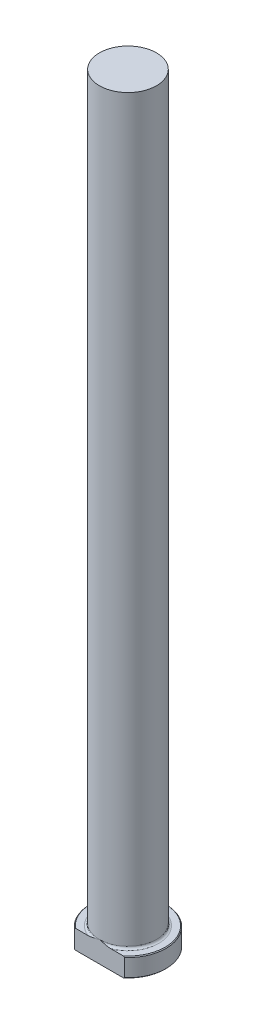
ISO-10303-21;
HEADER;
FILE_DESCRIPTION(('STEP AP214'),'2;1');
FILE_NAME('part.step','',(''),(''),'','','');
FILE_SCHEMA(('AUTOMOTIVE_DESIGN { 1 0 10303 214 1 1 1 1 }'));
ENDSEC;
DATA;
#1=APPLICATION_CONTEXT('core data for automotive mechanical design processes');
#2=APPLICATION_PROTOCOL_DEFINITION('international standard','automotive_design',2000,#1);
#3=PRODUCT_CONTEXT('',#1,'mechanical');
#4=PRODUCT('Part','Part','',(#3));
#5=PRODUCT_RELATED_PRODUCT_CATEGORY('part','',(#4));
#6=PRODUCT_DEFINITION_FORMATION('','',#4);
#7=PRODUCT_DEFINITION_CONTEXT('part definition',#1,'design');
#8=PRODUCT_DEFINITION('design','',#6,#7);
#9=PRODUCT_DEFINITION_SHAPE('','',#8);
#10=(LENGTH_UNIT() NAMED_UNIT(*) SI_UNIT(.MILLI.,.METRE.));
#11=(NAMED_UNIT(*) PLANE_ANGLE_UNIT() SI_UNIT($,.RADIAN.));
#12=(NAMED_UNIT(*) SI_UNIT($,.STERADIAN.) SOLID_ANGLE_UNIT());
#13=UNCERTAINTY_MEASURE_WITH_UNIT(LENGTH_MEASURE(1.E-05),#10,'distance_accuracy_value','');
#14=(GEOMETRIC_REPRESENTATION_CONTEXT(3) GLOBAL_UNCERTAINTY_ASSIGNED_CONTEXT((#13)) GLOBAL_UNIT_ASSIGNED_CONTEXT((#10,
#11,#12)) REPRESENTATION_CONTEXT('',''));
#15=CARTESIAN_POINT('',(0.,0.,0.));
#16=DIRECTION('',(0.,0.,1.));
#17=DIRECTION('',(1.,0.,0.));
#18=AXIS2_PLACEMENT_3D('',#15,#16,#17);
#19=CARTESIAN_POINT('',(0.,0.,0.));
#20=DIRECTION('',(0.,-1.,0.));
#21=DIRECTION('',(0.,0.,-1.));
#22=AXIS2_PLACEMENT_3D('',#19,#20,#21);
#23=PLANE('',#22);
#24=DIRECTION('',(1.,0.,0.));
#25=VECTOR('',#24,1.);
#26=CARTESIAN_POINT('',(-8.40026041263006,0.,9.52499999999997));
#27=LINE('',#26,#25);
#28=CARTESIAN_POINT('',(-8.01107302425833,0.,9.52499999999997));
#29=VERTEX_POINT('',#28);
#30=CARTESIAN_POINT('',(8.01107302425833,0.,9.52499999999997));
#31=VERTEX_POINT('',#30);
#32=EDGE_CURVE('E92',#29,#31,#27,.T.);
#33=ORIENTED_EDGE('',*,*,#32,.F.);
#34=CARTESIAN_POINT('',(0.,0.,0.));
#35=DIRECTION('',(0.,-1.,0.));
#36=DIRECTION('',(0.,0.,-1.));
#37=AXIS2_PLACEMENT_3D('',#34,#35,#36);
#38=CIRCLE('',#37,12.446);
#39=EDGE_CURVE('E105',#29,#31,#38,.T.);
#40=ORIENTED_EDGE('',*,*,#39,.T.);
#41=EDGE_LOOP('',(#33,#40));
#42=FACE_BOUND('',#41,.T.);
#43=ADVANCED_FACE('F37',(#42),#23,.T.);
#44=CARTESIAN_POINT('',(0.,259.958771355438,0.));
#45=DIRECTION('',(0.,1.,0.));
#46=DIRECTION('',(0.,0.,1.));
#47=AXIS2_PLACEMENT_3D('',#44,#45,#46);
#48=CYLINDRICAL_SURFACE('',#47,12.7);
#49=DIRECTION('',(0.,-1.,0.));
#50=VECTOR('',#49,1.);
#51=CARTESIAN_POINT('',(-8.40026041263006,254.,9.52499999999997));
#52=LINE('',#51,#50);
#53=CARTESIAN_POINT('',(-8.40026041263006,6.09600000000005,9.52499999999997));
#54=VERTEX_POINT('',#53);
#55=CARTESIAN_POINT('',(-8.40026041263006,0.253999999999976,9.52499999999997));
#56=VERTEX_POINT('',#55);
#57=EDGE_CURVE('E95',#54,#56,#52,.T.);
#58=ORIENTED_EDGE('',*,*,#57,.F.);
#59=CARTESIAN_POINT('',(0.,6.09600000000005,0.));
#60=DIRECTION('',(0.,1.,0.));
#61=DIRECTION('',(0.,0.,1.));
#62=AXIS2_PLACEMENT_3D('',#59,#60,#61);
#63=CIRCLE('',#62,12.7);
#64=CARTESIAN_POINT('',(8.40026041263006,6.09600000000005,9.52499999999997));
#65=VERTEX_POINT('',#64);
#66=EDGE_CURVE('E109',#54,#65,#63,.F.);
#67=ORIENTED_EDGE('',*,*,#66,.T.);
#68=DIRECTION('',(0.,-1.,0.));
#69=VECTOR('',#68,1.);
#70=CARTESIAN_POINT('',(8.40026041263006,254.,9.52499999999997));
#71=LINE('',#70,#69);
#72=CARTESIAN_POINT('',(8.40026041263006,0.253999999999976,9.52499999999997));
#73=VERTEX_POINT('',#72);
#74=EDGE_CURVE('E187',#65,#73,#71,.T.);
#75=ORIENTED_EDGE('',*,*,#74,.T.);
#76=CARTESIAN_POINT('',(0.,0.253999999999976,0.));
#77=DIRECTION('',(0.,-1.,0.));
#78=DIRECTION('',(0.,0.,-1.));
#79=AXIS2_PLACEMENT_3D('',#76,#77,#78);
#80=CIRCLE('',#79,12.7);
#81=EDGE_CURVE('E115',#73,#56,#80,.F.);
#82=ORIENTED_EDGE('',*,*,#81,.T.);
#83=EDGE_LOOP('',(#58,#67,#75,#82));
#84=FACE_BOUND('',#83,.T.);
#85=ADVANCED_FACE('F160',(#84),#48,.T.);
#86=CARTESIAN_POINT('',(-12.7,6.35,0.));
#87=DIRECTION('',(0.,1.,0.));
#88=DIRECTION('',(0.,0.,1.));
#89=AXIS2_PLACEMENT_3D('',#86,#87,#88);
#90=PLANE('',#89);
#91=DIRECTION('',(-1.,0.,0.));
#92=VECTOR('',#91,1.);
#93=CARTESIAN_POINT('',(-12.7,6.35,9.52499999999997));
#94=LINE('',#93,#92);
#95=CARTESIAN_POINT('',(8.01107302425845,6.35,9.52499999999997));
#96=VERTEX_POINT('',#95);
#97=CARTESIAN_POINT('',(3.88545286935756,6.35,9.52500000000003));
#98=VERTEX_POINT('',#97);
#99=EDGE_CURVE('E58',#96,#98,#94,.T.);
#100=ORIENTED_EDGE('',*,*,#99,.F.);
#101=CARTESIAN_POINT('',(0.,6.35,0.));
#102=DIRECTION('',(0.,1.,0.));
#103=DIRECTION('',(0.,0.,1.));
#104=AXIS2_PLACEMENT_3D('',#101,#102,#103);
#105=CIRCLE('',#104,12.446);
#106=CARTESIAN_POINT('',(-8.01107302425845,6.35,9.52499999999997));
#107=VERTEX_POINT('',#106);
#108=EDGE_CURVE('E182',#96,#107,#105,.T.);
#109=ORIENTED_EDGE('',*,*,#108,.T.);
#110=CARTESIAN_POINT('',(-3.8854528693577,6.35000000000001,9.52499999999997));
#111=VERTEX_POINT('',#110);
#112=EDGE_CURVE('E140',#111,#107,#94,.T.);
#113=ORIENTED_EDGE('',*,*,#112,.F.);
#114=CARTESIAN_POINT('',(0.,6.35,0.));
#115=DIRECTION('',(0.,1.,0.));
#116=DIRECTION('',(0.,0.,1.));
#117=AXIS2_PLACEMENT_3D('',#114,#115,#116);
#118=CIRCLE('',#117,10.287);
#119=EDGE_CURVE('E112',#111,#98,#118,.F.);
#120=ORIENTED_EDGE('',*,*,#119,.T.);
#121=EDGE_LOOP('',(#100,#109,#113,#120));
#122=FACE_BOUND('',#121,.T.);
#123=ADVANCED_FACE('F164',(#122),#90,.T.);
#124=CARTESIAN_POINT('',(0.,259.958771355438,0.));
#125=DIRECTION('',(0.,1.,0.));
#126=DIRECTION('',(0.,0.,1.));
#127=AXIS2_PLACEMENT_3D('',#124,#125,#126);
#128=CYLINDRICAL_SURFACE('',#127,9.52499999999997);
#129=CARTESIAN_POINT('',(0.,7.11200000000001,0.));
#130=DIRECTION('',(0.,1.,0.));
#131=DIRECTION('',(0.,0.,1.));
#132=AXIS2_PLACEMENT_3D('',#129,#130,#131);
#133=CIRCLE('',#132,9.52499999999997);
#134=CARTESIAN_POINT('',(0.,7.11200000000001,9.52499999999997));
#135=VERTEX_POINT('',#134);
#136=EDGE_CURVE('E108',#135,#135,#133,.T.);
#137=ORIENTED_EDGE('',*,*,#136,.T.);
#138=EDGE_LOOP('',(#137));
#139=FACE_BOUND('',#138,.T.);
#140=CARTESIAN_POINT('',(0.,254.,0.));
#141=DIRECTION('',(0.,1.,0.));
#142=DIRECTION('',(0.,0.,1.));
#143=AXIS2_PLACEMENT_3D('',#140,#141,#142);
#144=CIRCLE('',#143,9.52499999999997);
#145=CARTESIAN_POINT('',(0.,254.,9.52499999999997));
#146=VERTEX_POINT('',#145);
#147=EDGE_CURVE('E100',#146,#146,#144,.T.);
#148=ORIENTED_EDGE('',*,*,#147,.F.);
#149=EDGE_LOOP('',(#148));
#150=FACE_BOUND('',#149,.T.);
#151=ADVANCED_FACE('F169',(#139,#150),#128,.T.);
#152=CARTESIAN_POINT('',(-9.52499999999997,254.,0.));
#153=DIRECTION('',(0.,1.,0.));
#154=DIRECTION('',(0.,0.,1.));
#155=AXIS2_PLACEMENT_3D('',#152,#153,#154);
#156=PLANE('',#155);
#157=ORIENTED_EDGE('',*,*,#147,.T.);
#158=EDGE_LOOP('',(#157));
#159=FACE_BOUND('',#158,.T.);
#160=ADVANCED_FACE('F127',(#159),#156,.T.);
#161=CARTESIAN_POINT('',(0.,6.35000000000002,0.));
#162=DIRECTION('',(0.,-1.,0.));
#163=DIRECTION('',(0.,0.,-1.));
#164=AXIS2_PLACEMENT_3D('',#161,#162,#163);
#165=CONICAL_SURFACE('',#164,12.446,0.785398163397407);
#166=CARTESIAN_POINT('',(8.40096041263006,6.09553698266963,9.52499999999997));
#167=CARTESIAN_POINT('',(8.19718581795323,6.2303033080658,9.52499999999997));
#168=CARTESIAN_POINT('',(7.99214985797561,6.36319262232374,9.52499999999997));
#169=CARTESIAN_POINT('',(7.5792065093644,6.6245467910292,9.52499999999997));
#170=CARTESIAN_POINT('',(7.37129839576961,6.75301049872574,9.52499999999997));
#171=CARTESIAN_POINT('',(6.95126718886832,7.00543364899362,9.52499999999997));
#172=CARTESIAN_POINT('',(6.73912770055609,7.12936591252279,9.52499999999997));
#173=CARTESIAN_POINT('',(6.31139906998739,7.37110427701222,9.52499999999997));
#174=CARTESIAN_POINT('',(6.09581015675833,7.48891078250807,9.52499999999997));
#175=CARTESIAN_POINT('',(5.65453104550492,7.7206633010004,9.52499999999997));
#176=CARTESIAN_POINT('',(5.42872918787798,7.83439842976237,9.52499999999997));
#177=CARTESIAN_POINT('',(4.97282450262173,8.05288274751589,9.52499999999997));
#178=CARTESIAN_POINT('',(4.74272123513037,8.15763101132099,9.52499999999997));
#179=CARTESIAN_POINT('',(4.04643746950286,8.45561605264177,9.52499999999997));
#180=CARTESIAN_POINT('',(3.57320500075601,8.63317555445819,9.52499999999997));
#181=CARTESIAN_POINT('',(2.80813865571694,8.86932335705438,9.52499999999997));
#182=CARTESIAN_POINT('',(2.52209293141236,8.94676233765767,9.52499999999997));
#183=CARTESIAN_POINT('',(1.94462351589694,9.07858092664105,9.52499999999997));
#184=CARTESIAN_POINT('',(1.65319965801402,9.13295981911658,9.52499999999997));
#185=CARTESIAN_POINT('',(1.07015395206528,9.21536221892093,9.52499999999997));
#186=CARTESIAN_POINT('',(0.778576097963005,9.2436929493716,9.52499999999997));
#187=CARTESIAN_POINT('',(0.194046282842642,9.27349396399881,9.52499999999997));
#188=CARTESIAN_POINT('',(-0.0989055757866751,9.2749662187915,9.52499999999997));
#189=CARTESIAN_POINT('',(-0.683872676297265,9.25095810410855,9.52499999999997));
#190=CARTESIAN_POINT('',(-0.975887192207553,9.2254603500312,9.52499999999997));
#191=CARTESIAN_POINT('',(-1.55653301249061,9.14895259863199,9.52499999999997));
#192=CARTESIAN_POINT('',(-1.84516392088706,9.09793964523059,9.52499999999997));
#193=CARTESIAN_POINT('',(-2.42072160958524,8.97227081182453,9.52499999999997));
#194=CARTESIAN_POINT('',(-2.70758843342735,8.89734394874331,9.52499999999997));
#195=CARTESIAN_POINT('',(-3.27518068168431,8.72728200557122,9.52499999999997));
#196=CARTESIAN_POINT('',(-3.55590612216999,8.63214697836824,9.52499999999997));
#197=CARTESIAN_POINT('',(-4.24390979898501,8.3752879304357,9.52499999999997));
#198=CARTESIAN_POINT('',(-4.64741314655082,8.203492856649,9.52499999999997));
#199=CARTESIAN_POINT('',(-5.4415533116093,7.83184358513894,9.52499999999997));
#200=CARTESIAN_POINT('',(-5.83217587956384,7.63195951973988,9.52499999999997));
#201=CARTESIAN_POINT('',(-6.40414722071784,7.31931527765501,9.52499999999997));
#202=CARTESIAN_POINT('',(-6.58993168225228,7.21453897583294,9.52499999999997));
#203=CARTESIAN_POINT('',(-6.95899440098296,7.00063707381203,9.52499999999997));
#204=CARTESIAN_POINT('',(-7.14227255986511,6.89151130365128,9.52499999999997));
#205=CARTESIAN_POINT('',(-7.50600703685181,6.66978760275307,9.52499999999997));
#206=CARTESIAN_POINT('',(-7.68646980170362,6.55720020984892,9.52499999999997));
#207=CARTESIAN_POINT('',(-8.04526049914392,6.32873093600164,9.52499999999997));
#208=CARTESIAN_POINT('',(-8.22358875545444,6.21284956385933,9.52499999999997));
#209=CARTESIAN_POINT('',(-8.40096041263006,6.09553698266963,9.52499999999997));
#210=B_SPLINE_CURVE_WITH_KNOTS('',3,(#166,#167,#168,#169,#170,#171,#172,#173,#174,#175,#176,
#177,#178,#179,#180,#181,#182,#183,#184,#185,#186,#187,#188,#189,#190,#191,#192,#193,#194,#195,
#196,#197,#198,#199,#200,#201,#202,#203,#204,#205,#206,#207,#208,#209),.UNSPECIFIED.,.F.,.F.,(4,
2,2,2,2,2,2,2,2,2,2,2,2,2,2,2,2,2,2,2,2,4),(0.,0.73293596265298,1.46606043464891,
2.20303266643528,2.93995616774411,3.69824043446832,4.45660267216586,5.96966141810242,
6.85792094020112,7.74620803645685,8.62387862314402,9.50148481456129,10.3796570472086,
11.2579310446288,12.1465334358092,13.0351335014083,14.349271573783,15.6648177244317,
16.3046515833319,16.9445104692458,17.582583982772,18.2205594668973),.UNSPECIFIED.);
#211=EDGE_CURVE('E63',#65,#96,#210,.T.);
#212=ORIENTED_EDGE('',*,*,#211,.F.);
#213=ORIENTED_EDGE('',*,*,#66,.F.);
#214=EDGE_CURVE('E133',#107,#54,#210,.T.);
#215=ORIENTED_EDGE('',*,*,#214,.F.);
#216=ORIENTED_EDGE('',*,*,#108,.F.);
#217=EDGE_LOOP('',(#212,#213,#215,#216));
#218=FACE_BOUND('',#217,.T.);
#219=ADVANCED_FACE('F147',(#218),#165,.T.);
#220=CARTESIAN_POINT('',(0.,0.253999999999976,0.));
#221=DIRECTION('',(0.,1.,0.));
#222=DIRECTION('',(0.,0.,1.));
#223=AXIS2_PLACEMENT_3D('',#220,#221,#222);
#224=CONICAL_SURFACE('',#223,12.7,0.785398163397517);
#225=CARTESIAN_POINT('',(-8.40096041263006,0.254463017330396,9.52499999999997));
#226=CARTESIAN_POINT('',(-8.19718581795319,0.119696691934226,9.52499999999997));
#227=CARTESIAN_POINT('',(-7.99214985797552,-0.0131926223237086,9.52499999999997));
#228=CARTESIAN_POINT('',(-7.57920650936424,-0.274546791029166,9.52499999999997));
#229=CARTESIAN_POINT('',(-7.37129839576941,-0.403010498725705,9.52499999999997));
#230=CARTESIAN_POINT('',(-6.95126718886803,-0.65543364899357,9.52499999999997));
#231=CARTESIAN_POINT('',(-6.73912770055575,-0.779365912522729,9.52499999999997));
#232=CARTESIAN_POINT('',(-6.31139906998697,-1.02110427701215,9.52499999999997));
#233=CARTESIAN_POINT('',(-6.09581015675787,-1.13891078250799,9.52499999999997));
#234=CARTESIAN_POINT('',(-5.65453104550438,-1.3706633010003,9.52499999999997));
#235=CARTESIAN_POINT('',(-5.4287291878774,-1.48439842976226,9.52499999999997));
#236=CARTESIAN_POINT('',(-4.97282450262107,-1.70288274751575,9.52499999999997));
#237=CARTESIAN_POINT('',(-4.74272123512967,-1.80763101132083,9.52499999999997));
#238=CARTESIAN_POINT('',(-4.04643746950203,-2.10561605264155,9.52499999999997));
#239=CARTESIAN_POINT('',(-3.57320500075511,-2.28317555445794,9.52499999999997));
#240=CARTESIAN_POINT('',(-2.80813865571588,-2.51932335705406,9.52499999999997));
#241=CARTESIAN_POINT('',(-2.52209293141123,-2.59676233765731,9.52499999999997));
#242=CARTESIAN_POINT('',(-1.94462351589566,-2.72858092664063,9.52499999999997));
#243=CARTESIAN_POINT('',(-1.65319965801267,-2.78295981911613,9.52499999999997));
#244=CARTESIAN_POINT('',(-1.0701539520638,-2.86536221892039,9.52499999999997));
#245=CARTESIAN_POINT('',(-0.778576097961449,-2.89369294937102,9.52499999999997));
#246=CARTESIAN_POINT('',(-0.194046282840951,-2.92349396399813,9.52499999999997));
#247=CARTESIAN_POINT('',(0.0989055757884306,-2.92496621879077,9.52499999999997));
#248=CARTESIAN_POINT('',(0.683872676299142,-2.9009581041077,9.52499999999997));
#249=CARTESIAN_POINT('',(0.975887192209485,-2.8754603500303,9.52499999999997));
#250=CARTESIAN_POINT('',(1.55653301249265,-2.79895259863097,9.52499999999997));
#251=CARTESIAN_POINT('',(1.84516392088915,-2.74793964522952,9.52499999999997));
#252=CARTESIAN_POINT('',(2.42072160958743,-2.62227081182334,9.52499999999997));
#253=CARTESIAN_POINT('',(2.70758843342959,-2.54734394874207,9.52499999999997));
#254=CARTESIAN_POINT('',(3.27518068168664,-2.37728200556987,9.52499999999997));
#255=CARTESIAN_POINT('',(3.55590612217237,-2.28214697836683,9.52499999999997));
#256=CARTESIAN_POINT('',(4.24390979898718,-2.02528793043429,9.52499999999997));
#257=CARTESIAN_POINT('',(4.64741314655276,-1.85349285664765,9.52499999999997));
#258=CARTESIAN_POINT('',(5.4415533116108,-1.48184358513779,9.52499999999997));
#259=CARTESIAN_POINT('',(5.83217587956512,-1.28195951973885,9.52499999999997));
#260=CARTESIAN_POINT('',(6.40414722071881,-0.969315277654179,9.52499999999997));
#261=CARTESIAN_POINT('',(6.58993168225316,-0.864538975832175,9.52499999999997));
#262=CARTESIAN_POINT('',(6.95899440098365,-0.6506370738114,9.52499999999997));
#263=CARTESIAN_POINT('',(7.14227255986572,-0.541511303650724,9.52499999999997));
#264=CARTESIAN_POINT('',(7.50600703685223,-0.319787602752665,9.52499999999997));
#265=CARTESIAN_POINT('',(7.68646980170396,-0.207200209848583,9.52499999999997));
#266=CARTESIAN_POINT('',(8.04526049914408,0.0212690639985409,9.52499999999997));
#267=CARTESIAN_POINT('',(8.22358875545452,0.13715043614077,9.52499999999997));
#268=CARTESIAN_POINT('',(8.40096041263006,0.254463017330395,9.52499999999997));
#269=B_SPLINE_CURVE_WITH_KNOTS('',3,(#225,#226,#227,#228,#229,#230,#231,#232,#233,#234,#235,
#236,#237,#238,#239,#240,#241,#242,#243,#244,#245,#246,#247,#248,#249,#250,#251,#252,#253,#254,
#255,#256,#257,#258,#259,#260,#261,#262,#263,#264,#265,#266,#267,#268),.UNSPECIFIED.,.F.,.F.,(4,
2,2,2,2,2,2,2,2,2,2,2,2,2,2,2,2,2,2,2,2,4),(0.,0.732935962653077,1.46606043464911,
2.20303266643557,2.9399561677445,3.6982404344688,4.45660267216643,5.96966141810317,
6.85792094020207,7.74620803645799,8.62387862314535,9.50148481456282,10.3796570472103,
11.2579310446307,12.1465334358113,13.0351335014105,14.3492715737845,15.6648177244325,
16.3046515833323,16.9445104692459,17.5825839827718,18.2205594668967),.UNSPECIFIED.);
#270=EDGE_CURVE('E89',#56,#29,#269,.T.);
#271=ORIENTED_EDGE('',*,*,#270,.F.);
#272=ORIENTED_EDGE('',*,*,#81,.F.);
#273=EDGE_CURVE('E101',#31,#73,#269,.T.);
#274=ORIENTED_EDGE('',*,*,#273,.F.);
#275=ORIENTED_EDGE('',*,*,#39,.F.);
#276=EDGE_LOOP('',(#271,#272,#274,#275));
#277=FACE_BOUND('',#276,.T.);
#278=ADVANCED_FACE('F107',(#277),#224,.T.);
#279=CARTESIAN_POINT('',(0.,7.11200000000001,0.));
#280=DIRECTION('',(0.,1.,0.));
#281=DIRECTION('',(0.,0.,1.));
#282=AXIS2_PLACEMENT_3D('',#279,#280,#281);
#283=TOROIDAL_SURFACE('',#282,10.287,0.762);
#284=ORIENTED_EDGE('',*,*,#119,.F.);
#285=CARTESIAN_POINT('',(0.,7.11200000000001,9.52499999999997));
#286=CARTESIAN_POINT('',(9.44793943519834E-11,7.11200098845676,9.52499999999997));
#287=CARTESIAN_POINT('',(-3.32154461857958E-07,7.11200197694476,9.52499999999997));
#288=CARTESIAN_POINT('',(-1.28451417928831E-06,7.11200383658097,9.52499999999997));
#289=CARTESIAN_POINT('',(-1.92426569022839E-06,7.11200469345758,9.52499999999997));
#290=CARTESIAN_POINT('',(-3.45251543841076E-06,7.11200645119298,9.52499999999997));
#291=CARTESIAN_POINT('',(-4.36508559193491E-06,7.11200733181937,9.52499999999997));
#292=CARTESIAN_POINT('',(-6.27569859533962E-06,7.11200893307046,9.52499999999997));
#293=CARTESIAN_POINT('',(-7.27105423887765E-06,7.1120096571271,9.52499999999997));
#294=CARTESIAN_POINT('',(-1.10531115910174E-05,7.11201227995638,9.52499999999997));
#295=CARTESIAN_POINT('',(-1.39454463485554E-05,7.11201403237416,9.52499999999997));
#296=CARTESIAN_POINT('',(-1.97324604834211E-05,7.11201697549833,9.52499999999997));
#297=CARTESIAN_POINT('',(-2.26119117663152E-05,7.11201819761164,9.52499999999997));
#298=CARTESIAN_POINT('',(-3.45848727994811E-05,7.11202320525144,9.52499999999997));
#299=CARTESIAN_POINT('',(-4.37413910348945E-05,7.11202685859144,9.52499999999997));
#300=CARTESIAN_POINT('',(-6.11943991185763E-05,7.11203235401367,9.52499999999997));
#301=CARTESIAN_POINT('',(-6.94339668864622E-05,7.11203437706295,9.52499999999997));
#302=CARTESIAN_POINT('',(-0.000130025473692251,7.11204892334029,9.52499999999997));
#303=CARTESIAN_POINT('',(-0.000182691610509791,7.1120597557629,9.52499999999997));
#304=CARTESIAN_POINT('',(-0.000390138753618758,7.11210716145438,9.52499999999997));
#305=CARTESIAN_POINT('',(-0.00054283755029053,7.11215258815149,9.52499999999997));
#306=CARTESIAN_POINT('',(-0.0011461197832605,7.11232885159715,9.52499999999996));
#307=CARTESIAN_POINT('',(-0.00159790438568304,7.11245379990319,9.52499999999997));
#308=CARTESIAN_POINT('',(-0.00338883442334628,7.11295304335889,9.52499999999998));
#309=CARTESIAN_POINT('',(-0.00472645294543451,7.11333464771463,9.52499999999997));
#310=CARTESIAN_POINT('',(-0.0103022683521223,7.11492091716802,9.52499999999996));
#311=CARTESIAN_POINT('',(-0.0145423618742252,7.11611650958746,9.52499999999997));
#312=CARTESIAN_POINT('',(-0.0867192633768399,7.13647430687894,9.52500000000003));
#313=CARTESIAN_POINT('',(-0.154638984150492,7.15571958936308,9.52499999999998));
#314=CARTESIAN_POINT('',(-0.287767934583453,7.19329752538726,9.52499999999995));
#315=CARTESIAN_POINT('',(-0.352975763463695,7.21163562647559,9.52499999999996));
#316=CARTESIAN_POINT('',(-0.491737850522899,7.25049193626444,9.52499999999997));
#317=CARTESIAN_POINT('',(-0.565297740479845,7.27099045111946,9.52499999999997));
#318=CARTESIAN_POINT('',(-0.713319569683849,7.3119035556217,9.52499999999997));
#319=CARTESIAN_POINT('',(-0.787782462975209,7.33231469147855,9.52499999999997));
#320=CARTESIAN_POINT('',(-0.915230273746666,7.36685900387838,9.52499999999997));
#321=CARTESIAN_POINT('',(-0.968186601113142,7.38109752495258,9.52499999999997));
#322=CARTESIAN_POINT('',(-1.07403059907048,7.40928089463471,9.52499999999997));
#323=CARTESIAN_POINT('',(-1.12691809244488,7.42322640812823,9.52499999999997));
#324=CARTESIAN_POINT('',(-1.28301939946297,7.46391694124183,9.52499999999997));
#325=CARTESIAN_POINT('',(-1.38634232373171,7.49024387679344,9.52499999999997));
#326=CARTESIAN_POINT('',(-1.68944304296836,7.56519607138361,9.52499999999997));
#327=CARTESIAN_POINT('',(-1.8897205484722,7.61183337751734,9.52499999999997));
#328=CARTESIAN_POINT('',(-2.29400914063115,7.69737651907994,9.52499999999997));
#329=CARTESIAN_POINT('',(-2.49803760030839,7.73620305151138,9.52499999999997));
#330=CARTESIAN_POINT('',(-2.81387823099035,7.78683388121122,9.52499999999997));
#331=CARTESIAN_POINT('',(-2.92501123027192,7.80285941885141,9.52499999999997));
#332=CARTESIAN_POINT('',(-3.14779936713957,7.83067921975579,9.52499999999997));
#333=CARTESIAN_POINT('',(-3.2594544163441,7.84247417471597,9.52499999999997));
#334=CARTESIAN_POINT('',(-3.48278494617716,7.86090616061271,9.52499999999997));
#335=CARTESIAN_POINT('',(-3.59445882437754,7.86756210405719,9.52499999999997));
#336=CARTESIAN_POINT('',(-3.81798645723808,7.87464978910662,9.52499999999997));
#337=CARTESIAN_POINT('',(-3.92984010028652,7.87508450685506,9.52499999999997));
#338=CARTESIAN_POINT('',(-4.10822628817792,7.86957869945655,9.52499999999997));
#339=CARTESIAN_POINT('',(-4.17483681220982,7.86613953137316,9.52499999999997));
#340=CARTESIAN_POINT('',(-4.30786151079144,7.85605502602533,9.52499999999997));
#341=CARTESIAN_POINT('',(-4.37427555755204,7.84940793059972,9.52499999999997));
#342=CARTESIAN_POINT('',(-4.50574043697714,7.83247477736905,9.52499999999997));
#343=CARTESIAN_POINT('',(-4.57079758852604,7.82223888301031,9.52499999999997));
#344=CARTESIAN_POINT('',(-4.70005884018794,7.79743182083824,9.52499999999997));
#345=CARTESIAN_POINT('',(-4.76426346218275,7.78286344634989,9.52499999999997));
#346=CARTESIAN_POINT('',(-4.88990898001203,7.74883316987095,9.52499999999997));
#347=CARTESIAN_POINT('',(-4.95137961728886,7.72948310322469,9.52499999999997));
#348=CARTESIAN_POINT('',(-5.07224009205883,7.68446325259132,9.52499999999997));
#349=CARTESIAN_POINT('',(-5.13162393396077,7.6587767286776,9.52499999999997));
#350=CARTESIAN_POINT('',(-5.23453598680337,7.60548582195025,9.52499999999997));
#351=CARTESIAN_POINT('',(-5.27881787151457,7.57935572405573,9.52499999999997));
#352=CARTESIAN_POINT('',(-5.36306427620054,7.52087999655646,9.52499999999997));
#353=CARTESIAN_POINT('',(-5.40304304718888,7.48855593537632,9.52499999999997));
#354=CARTESIAN_POINT('',(-5.46004966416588,7.43195018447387,9.52499999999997));
#355=CARTESIAN_POINT('',(-5.47955836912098,7.41018001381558,9.52499999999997));
#356=CARTESIAN_POINT('',(-5.51527668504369,7.36405786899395,9.52499999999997));
#357=CARTESIAN_POINT('',(-5.5314898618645,7.3397087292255,9.52499999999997));
#358=CARTESIAN_POINT('',(-5.55708157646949,7.2929027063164,9.52499999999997));
#359=CARTESIAN_POINT('',(-5.56715375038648,7.27082932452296,9.52499999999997));
#360=CARTESIAN_POINT('',(-5.58350208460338,7.22531141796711,9.52499999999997));
#361=CARTESIAN_POINT('',(-5.58978181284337,7.20186820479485,9.52499999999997));
#362=CARTESIAN_POINT('',(-5.597992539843,7.15405846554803,9.52499999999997));
#363=CARTESIAN_POINT('',(-5.5998952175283,7.12968695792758,9.52499999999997));
#364=CARTESIAN_POINT('',(-5.59905756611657,7.08102434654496,9.52499999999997));
#365=CARTESIAN_POINT('',(-5.59631730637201,7.05673324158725,9.52499999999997));
#366=CARTESIAN_POINT('',(-5.58698559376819,7.01144696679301,9.52499999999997));
#367=CARTESIAN_POINT('',(-5.58080461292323,6.99036439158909,9.52499999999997));
#368=CARTESIAN_POINT('',(-5.56539036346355,6.94936001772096,9.52499999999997));
#369=CARTESIAN_POINT('',(-5.556156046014,6.92943862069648,9.52499999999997));
#370=CARTESIAN_POINT('',(-5.5298398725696,6.88122286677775,9.52499999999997));
#371=CARTESIAN_POINT('',(-5.51115325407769,6.85380627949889,9.52499999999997));
#372=CARTESIAN_POINT('',(-5.46970194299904,6.80224417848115,9.52499999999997));
#373=CARTESIAN_POINT('',(-5.44692558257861,6.77810838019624,9.52499999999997));
#374=CARTESIAN_POINT('',(-5.38302390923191,6.71837292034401,9.52499999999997));
#375=CARTESIAN_POINT('',(-5.33950371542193,6.68535697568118,9.52499999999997));
#376=CARTESIAN_POINT('',(-5.24823311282,6.62605382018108,9.52499999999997));
#377=CARTESIAN_POINT('',(-5.20047793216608,6.59977433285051,9.52499999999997));
#378=CARTESIAN_POINT('',(-5.10393883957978,6.55334123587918,9.52499999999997));
#379=CARTESIAN_POINT('',(-5.05523269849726,6.53302299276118,9.52499999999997));
#380=CARTESIAN_POINT('',(-4.9562654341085,6.49653819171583,9.52499999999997));
#381=CARTESIAN_POINT('',(-4.906002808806,6.48037579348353,9.52499999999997));
#382=CARTESIAN_POINT('',(-4.80400444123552,6.45140427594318,9.52499999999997));
#383=CARTESIAN_POINT('',(-4.75225910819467,6.43862943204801,9.52499999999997));
#384=CARTESIAN_POINT('',(-4.64815423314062,6.41611875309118,9.52499999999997));
#385=CARTESIAN_POINT('',(-4.5957950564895,6.40638119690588,9.52499999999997));
#386=CARTESIAN_POINT('',(-4.46922305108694,6.3860769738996,9.52499999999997));
#387=CARTESIAN_POINT('',(-4.39480530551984,6.37679143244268,9.52499999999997));
#388=CARTESIAN_POINT('',(-4.24554902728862,6.36251533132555,9.52499999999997));
#389=CARTESIAN_POINT('',(-4.17071032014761,6.35752670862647,9.52499999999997));
#390=CARTESIAN_POINT('',(-3.94554241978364,6.34796961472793,9.52499999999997));
#391=CARTESIAN_POINT('',(-3.79497732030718,6.34886803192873,9.52499999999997));
#392=CARTESIAN_POINT('',(-3.50146085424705,6.36115019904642,9.52499999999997));
#393=CARTESIAN_POINT('',(-3.35848345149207,6.37204043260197,9.52499999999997));
#394=CARTESIAN_POINT('',(-3.0742637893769,6.40134428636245,9.52499999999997));
#395=CARTESIAN_POINT('',(-2.93301629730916,6.41970825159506,9.52499999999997));
#396=CARTESIAN_POINT('',(-2.69200870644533,6.45620557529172,9.52499999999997));
#397=CARTESIAN_POINT('',(-2.59202022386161,6.47288103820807,9.52499999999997));
#398=CARTESIAN_POINT('',(-2.39256281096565,6.50875277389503,9.52499999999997));
#399=CARTESIAN_POINT('',(-2.29309359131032,6.52794744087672,9.52499999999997));
#400=CARTESIAN_POINT('',(-2.0922148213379,6.5689415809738,9.52499999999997));
#401=CARTESIAN_POINT('',(-1.99081583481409,6.5907924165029,9.52499999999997));
#402=CARTESIAN_POINT('',(-1.78816599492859,6.63639281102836,9.52499999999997));
#403=CARTESIAN_POINT('',(-1.68691624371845,6.66014724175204,9.52499999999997));
#404=CARTESIAN_POINT('',(-1.44674283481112,6.7183773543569,9.52499999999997));
#405=CARTESIAN_POINT('',(-1.30798225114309,6.75352328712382,9.52499999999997));
#406=CARTESIAN_POINT('',(-1.03253770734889,6.82543172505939,9.52499999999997));
#407=CARTESIAN_POINT('',(-0.895847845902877,6.86217183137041,9.52499999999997));
#408=CARTESIAN_POINT('',(-0.698942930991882,6.91606570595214,9.52499999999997));
#409=CARTESIAN_POINT('',(-0.638589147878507,6.93271644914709,9.52499999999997));
#410=CARTESIAN_POINT('',(-0.517674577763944,6.96627853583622,9.52499999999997));
#411=CARTESIAN_POINT('',(-0.457114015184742,6.98319069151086,9.52499999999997));
#412=CARTESIAN_POINT('',(-0.33307447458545,7.0179593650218,9.52499999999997));
#413=CARTESIAN_POINT('',(-0.269597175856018,7.03582172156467,9.52499999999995));
#414=CARTESIAN_POINT('',(-0.143679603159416,7.07137859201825,9.52499999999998));
#415=CARTESIAN_POINT('',(-0.0812388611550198,7.08907126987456,9.52500000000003));
#416=CARTESIAN_POINT('',(-0.0145389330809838,7.10788447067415,9.52499999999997));
#417=CARTESIAN_POINT('',(-0.0102954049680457,7.1090810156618,9.52499999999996));
#418=CARTESIAN_POINT('',(-0.0047188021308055,7.11066751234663,9.52499999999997));
#419=CARTESIAN_POINT('',(-0.00338382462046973,7.11104836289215,9.52499999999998));
#420=CARTESIAN_POINT('',(-0.00159619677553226,7.11154668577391,9.52499999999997));
#421=CARTESIAN_POINT('',(-0.00114507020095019,7.11167145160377,9.52499999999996));
#422=CARTESIAN_POINT('',(-0.000542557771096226,7.11184749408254,9.52499999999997));
#423=CARTESIAN_POINT('',(-0.000389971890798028,7.11189288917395,9.52499999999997));
#424=CARTESIAN_POINT('',(-0.000182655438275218,7.11194026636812,9.52499999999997));
#425=CARTESIAN_POINT('',(-0.000130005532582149,7.11195109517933,9.52499999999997));
#426=CARTESIAN_POINT('',(-6.94304994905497E-05,7.11196563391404,9.52499999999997));
#427=CARTESIAN_POINT('',(-6.11918697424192E-05,7.11196765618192,9.52499999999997));
#428=CARTESIAN_POINT('',(-4.37407514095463E-05,7.11197314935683,9.52499999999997));
#429=CARTESIAN_POINT('',(-3.4585135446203E-05,7.11197680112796,9.52499999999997));
#430=CARTESIAN_POINT('',(-2.26130982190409E-05,7.11198180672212,9.52499999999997));
#431=CARTESIAN_POINT('',(-1.97337169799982E-05,7.11198302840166,9.52499999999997));
#432=CARTESIAN_POINT('',(-1.39467683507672E-05,7.11198597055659,9.52499999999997));
#433=CARTESIAN_POINT('',(-1.10544209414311E-05,7.11198772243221,9.52499999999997));
#434=CARTESIAN_POINT('',(-7.27225889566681E-06,7.1119903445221,9.52499999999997));
#435=CARTESIAN_POINT('',(-6.27685261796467E-06,7.11199106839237,9.52499999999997));
#436=CARTESIAN_POINT('',(-4.36610472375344E-06,7.11199266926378,9.52499999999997));
#437=CARTESIAN_POINT('',(-3.45344932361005E-06,7.11199354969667,9.52499999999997));
#438=CARTESIAN_POINT('',(-1.92499773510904E-06,7.11199530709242,9.52499999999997));
#439=CARTESIAN_POINT('',(-1.28513657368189E-06,7.11199616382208,9.52499999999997));
#440=CARTESIAN_POINT('',(-3.32502710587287E-07,7.11199802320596,9.52499999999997));
#441=CARTESIAN_POINT('',(-9.44751782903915E-11,7.11199901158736,9.52499999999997));
#442=CARTESIAN_POINT('',(0.,7.11200000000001,9.52499999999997));
#443=B_SPLINE_CURVE_WITH_KNOTS('',3,(#285,#286,#287,#288,#289,#290,#291,#292,#293,#294,#295,
#296,#297,#298,#299,#300,#301,#302,#303,#304,#305,#306,#307,#308,#309,#310,#311,#312,#313,#314,
#315,#316,#317,#318,#319,#320,#321,#322,#323,#324,#325,#326,#327,#328,#329,#330,#331,#332,#333,
#334,#335,#336,#337,#338,#339,#340,#341,#342,#343,#344,#345,#346,#347,#348,#349,#350,#351,#352,
#353,#354,#355,#356,#357,#358,#359,#360,#361,#362,#363,#364,#365,#366,#367,#368,#369,#370,#371,
#372,#373,#374,#375,#376,#377,#378,#379,#380,#381,#382,#383,#384,#385,#386,#387,#388,#389,#390,
#391,#392,#393,#394,#395,#396,#397,#398,#399,#400,#401,#402,#403,#404,#405,#406,#407,#408,#409,
#410,#411,#412,#413,#414,#415,#416,#417,#418,#419,#420,#421,#422,#423,#424,#425,#426,#427,#428,
#429,#430,#431,#432,#433,#434,#435,#436,#437,#438,#439,#440,#441,#442),.UNSPECIFIED.,.T.,.F.,(4,
2,2,2,2,2,2,2,2,2,2,2,2,2,2,2,2,2,2,2,2,2,2,2,2,2,2,2,2,2,2,2,2,2,2,2,2,2,2,2,2,2,2,2,2,2,2,2,2,
2,2,2,2,2,2,2,2,2,2,2,2,2,2,2,2,2,2,2,2,2,2,2,2,2,2,2,2,2,4),(0.,2.98024271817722E-06,
6.1830024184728E-06,9.96691583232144E-06,1.36568083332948E-05,2.37621907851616E-05,
3.31384090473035E-05,6.26536433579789E-05,8.80741001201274E-05,0.000249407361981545,
0.000726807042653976,0.00213358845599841,0.00630588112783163,0.0195229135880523,
0.231296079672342,0.434509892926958,0.663596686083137,0.895224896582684,1.0597356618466,
1.22382050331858,1.54368751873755,2.16049297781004,2.78327570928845,3.12006022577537,
3.45678965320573,3.79227386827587,4.12759758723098,4.32763355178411,4.52777927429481,
4.72523214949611,4.92255799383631,5.11564525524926,5.30924819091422,5.46313690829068,
5.61649918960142,5.7039699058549,5.79134546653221,5.86384674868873,5.93627971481,
6.00918004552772,6.08207928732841,6.14772258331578,6.21338845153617,6.31235848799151,
6.41161550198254,6.57457319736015,6.73771690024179,6.89580366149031,7.05404804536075,
7.21383723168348,7.37353570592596,7.59835636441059,7.82327831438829,8.27437601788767,
8.70432670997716,9.13146629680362,9.435543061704,9.7394269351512,10.0505865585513,
10.3625696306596,10.7919732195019,11.2165881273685,11.4044136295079,11.5930459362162,
11.7908757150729,11.9855654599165,11.9987931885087,12.0029572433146,12.0043619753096,
12.0048390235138,12.0050003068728,12.0050257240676,12.0050552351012,12.0050646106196,
12.0050747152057,12.0050784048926,12.0050821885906,12.0050853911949,12.0050883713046),.UNSPECIFIED.);
#444=EDGE_CURVE('E11',#111,#135,#443,.T.);
#445=ORIENTED_EDGE('',*,*,#444,.T.);
#446=ORIENTED_EDGE('',*,*,#136,.F.);
#447=CARTESIAN_POINT('',(0.,7.11200000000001,9.52499999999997));
#448=CARTESIAN_POINT('',(-9.44793377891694E-11,7.11199901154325,9.52499999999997));
#449=CARTESIAN_POINT('',(3.32154461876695E-07,7.11199802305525,9.52499999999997));
#450=CARTESIAN_POINT('',(1.28451417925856E-06,7.11199616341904,9.52499999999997));
#451=CARTESIAN_POINT('',(1.92426569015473E-06,7.11199530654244,9.52499999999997));
#452=CARTESIAN_POINT('',(3.45251543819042E-06,7.11199354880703,9.52499999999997));
#453=CARTESIAN_POINT('',(4.36508559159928E-06,7.11199266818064,9.52499999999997));
#454=CARTESIAN_POINT('',(6.27569859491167E-06,7.11199106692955,9.52499999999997));
#455=CARTESIAN_POINT('',(7.27105423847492E-06,7.11199034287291,9.52499999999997));
#456=CARTESIAN_POINT('',(1.1053111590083E-05,7.11198772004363,9.52499999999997));
#457=CARTESIAN_POINT('',(1.3945446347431E-05,7.11198596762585,9.52499999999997));
#458=CARTESIAN_POINT('',(1.97324604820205E-05,7.11198302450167,9.52499999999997));
#459=CARTESIAN_POINT('',(2.26119117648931E-05,7.11198180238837,9.52499999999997));
#460=CARTESIAN_POINT('',(3.45848727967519E-05,7.11197679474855,9.52499999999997));
#461=CARTESIAN_POINT('',(4.37413910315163E-05,7.11197314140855,9.52499999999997));
#462=CARTESIAN_POINT('',(6.11943991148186E-05,7.11196764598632,9.52499999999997));
#463=CARTESIAN_POINT('',(6.94339668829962E-05,7.11196562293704,9.52499999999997));
#464=CARTESIAN_POINT('',(0.000130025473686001,7.11195107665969,9.52499999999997));
#465=CARTESIAN_POINT('',(0.000182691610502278,7.11194024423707,9.52499999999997));
#466=CARTESIAN_POINT('',(0.000390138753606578,7.11189283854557,9.52499999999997));
#467=CARTESIAN_POINT('',(0.000542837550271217,7.11184741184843,9.52499999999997));
#468=CARTESIAN_POINT('',(0.00114611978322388,7.11167114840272,9.52499999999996));
#469=CARTESIAN_POINT('',(0.00159790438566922,7.11154620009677,9.52499999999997));
#470=CARTESIAN_POINT('',(0.00338883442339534,7.1110469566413,9.52499999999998));
#471=CARTESIAN_POINT('',(0.00472645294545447,7.11066535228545,9.52499999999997));
#472=CARTESIAN_POINT('',(0.0103022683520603,7.10907908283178,9.52499999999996));
#473=CARTESIAN_POINT('',(0.0145423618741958,7.10788349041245,9.52499999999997));
#474=CARTESIAN_POINT('',(0.0867192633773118,7.08752569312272,9.52500000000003));
#475=CARTESIAN_POINT('',(0.154638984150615,7.06828041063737,9.52499999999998));
#476=CARTESIAN_POINT('',(0.287767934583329,7.03070247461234,9.52499999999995));
#477=CARTESIAN_POINT('',(0.352975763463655,7.0123643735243,9.52499999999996));
#478=CARTESIAN_POINT('',(0.491737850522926,6.9735080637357,9.52499999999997));
#479=CARTESIAN_POINT('',(0.565297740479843,6.95300954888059,9.52499999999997));
#480=CARTESIAN_POINT('',(0.713319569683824,6.91209644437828,9.52499999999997));
#481=CARTESIAN_POINT('',(0.787782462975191,6.89168530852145,9.52499999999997));
#482=CARTESIAN_POINT('',(0.915230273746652,6.85714099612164,9.52499999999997));
#483=CARTESIAN_POINT('',(0.968186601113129,6.84290247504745,9.52499999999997));
#484=CARTESIAN_POINT('',(1.07403059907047,6.81471910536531,9.52499999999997));
#485=CARTESIAN_POINT('',(1.12691809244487,6.80077359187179,9.52499999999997));
#486=CARTESIAN_POINT('',(1.28301939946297,6.76008305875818,9.52499999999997));
#487=CARTESIAN_POINT('',(1.38634232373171,6.73375612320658,9.52499999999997));
#488=CARTESIAN_POINT('',(1.68944304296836,6.6588039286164,9.52499999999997));
#489=CARTESIAN_POINT('',(1.88972054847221,6.61216662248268,9.52499999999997));
#490=CARTESIAN_POINT('',(2.29400914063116,6.52662348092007,9.52499999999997));
#491=CARTESIAN_POINT('',(2.49803760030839,6.48779694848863,9.52499999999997));
#492=CARTESIAN_POINT('',(2.81387823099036,6.4371661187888,9.52499999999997));
#493=CARTESIAN_POINT('',(2.92501123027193,6.4211405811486,9.52499999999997));
#494=CARTESIAN_POINT('',(3.14779936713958,6.39332078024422,9.52499999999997));
#495=CARTESIAN_POINT('',(3.25945441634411,6.38152582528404,9.52499999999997));
#496=CARTESIAN_POINT('',(3.48278494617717,6.3630938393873,9.52499999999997));
#497=CARTESIAN_POINT('',(3.59445882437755,6.35643789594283,9.52499999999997));
#498=CARTESIAN_POINT('',(3.81798645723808,6.3493502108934,9.52499999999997));
#499=CARTESIAN_POINT('',(3.92984010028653,6.34891549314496,9.52499999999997));
#500=CARTESIAN_POINT('',(4.10822628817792,6.35442130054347,9.52499999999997));
#501=CARTESIAN_POINT('',(4.17483681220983,6.35786046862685,9.52499999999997));
#502=CARTESIAN_POINT('',(4.30786151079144,6.36794497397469,9.52499999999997));
#503=CARTESIAN_POINT('',(4.37427555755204,6.3745920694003,9.52499999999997));
#504=CARTESIAN_POINT('',(4.50574043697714,6.39152522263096,9.52499999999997));
#505=CARTESIAN_POINT('',(4.57079758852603,6.4017611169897,9.52499999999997));
#506=CARTESIAN_POINT('',(4.70005884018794,6.42656817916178,9.52499999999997));
#507=CARTESIAN_POINT('',(4.76426346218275,6.44113655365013,9.52499999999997));
#508=CARTESIAN_POINT('',(4.88990898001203,6.47516683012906,9.52499999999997));
#509=CARTESIAN_POINT('',(4.95137961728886,6.49451689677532,9.52499999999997));
#510=CARTESIAN_POINT('',(5.07224009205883,6.53953674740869,9.52499999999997));
#511=CARTESIAN_POINT('',(5.13162393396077,6.56522327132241,9.52499999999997));
#512=CARTESIAN_POINT('',(5.23453598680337,6.61851417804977,9.52499999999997));
#513=CARTESIAN_POINT('',(5.27881787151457,6.64464427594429,9.52499999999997));
#514=CARTESIAN_POINT('',(5.36306427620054,6.70312000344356,9.52499999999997));
#515=CARTESIAN_POINT('',(5.40304304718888,6.73544406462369,9.52499999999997));
#516=CARTESIAN_POINT('',(5.46004966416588,6.79204981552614,9.52499999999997));
#517=CARTESIAN_POINT('',(5.47955836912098,6.81381998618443,9.52499999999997));
#518=CARTESIAN_POINT('',(5.51527668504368,6.85994213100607,9.52499999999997));
#519=CARTESIAN_POINT('',(5.5314898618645,6.88429127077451,9.52499999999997));
#520=CARTESIAN_POINT('',(5.55708157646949,6.93109729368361,9.52499999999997));
#521=CARTESIAN_POINT('',(5.56715375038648,6.95317067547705,9.52499999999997));
#522=CARTESIAN_POINT('',(5.58350208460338,6.99868858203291,9.52499999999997));
#523=CARTESIAN_POINT('',(5.58978181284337,7.02213179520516,9.52499999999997));
#524=CARTESIAN_POINT('',(5.597992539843,7.06994153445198,9.52499999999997));
#525=CARTESIAN_POINT('',(5.5998952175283,7.09431304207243,9.52499999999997));
#526=CARTESIAN_POINT('',(5.59905756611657,7.14297565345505,9.52499999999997));
#527=CARTESIAN_POINT('',(5.59631730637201,7.16726675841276,9.52499999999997));
#528=CARTESIAN_POINT('',(5.58698559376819,7.212553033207,9.52499999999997));
#529=CARTESIAN_POINT('',(5.58080461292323,7.23363560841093,9.52499999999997));
#530=CARTESIAN_POINT('',(5.56539036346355,7.27463998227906,9.52499999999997));
#531=CARTESIAN_POINT('',(5.556156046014,7.29456137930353,9.52499999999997));
#532=CARTESIAN_POINT('',(5.5298398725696,7.34277713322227,9.52499999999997));
#533=CARTESIAN_POINT('',(5.51115325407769,7.37019372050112,9.52499999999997));
#534=CARTESIAN_POINT('',(5.46970194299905,7.42175582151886,9.52499999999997));
#535=CARTESIAN_POINT('',(5.44692558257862,7.44589161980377,9.52499999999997));
#536=CARTESIAN_POINT('',(5.38302390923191,7.505627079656,9.52499999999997));
#537=CARTESIAN_POINT('',(5.33950371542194,7.53864302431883,9.52499999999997));
#538=CARTESIAN_POINT('',(5.24823311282,7.59794617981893,9.52499999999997));
#539=CARTESIAN_POINT('',(5.20047793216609,7.62422566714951,9.52499999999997));
#540=CARTESIAN_POINT('',(5.10393883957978,7.67065876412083,9.52499999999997));
#541=CARTESIAN_POINT('',(5.05523269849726,7.69097700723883,9.52499999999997));
#542=CARTESIAN_POINT('',(4.95626543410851,7.72746180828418,9.52499999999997));
#543=CARTESIAN_POINT('',(4.90600280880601,7.74362420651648,9.52499999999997));
#544=CARTESIAN_POINT('',(4.80400444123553,7.77259572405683,9.52499999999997));
#545=CARTESIAN_POINT('',(4.75225910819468,7.785370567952,9.52499999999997));
#546=CARTESIAN_POINT('',(4.64815423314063,7.80788124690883,9.52499999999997));
#547=CARTESIAN_POINT('',(4.59579505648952,7.81761880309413,9.52499999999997));
#548=CARTESIAN_POINT('',(4.46922305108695,7.83792302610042,9.52499999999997));
#549=CARTESIAN_POINT('',(4.39480530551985,7.84720856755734,9.52499999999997));
#550=CARTESIAN_POINT('',(4.24554902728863,7.86148466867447,9.52499999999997));
#551=CARTESIAN_POINT('',(4.17071032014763,7.86647329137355,9.52499999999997));
#552=CARTESIAN_POINT('',(3.94554241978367,7.87603038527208,9.52499999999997));
#553=CARTESIAN_POINT('',(3.79497732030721,7.87513196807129,9.52499999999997));
#554=CARTESIAN_POINT('',(3.50146085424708,7.8628498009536,9.52499999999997));
#555=CARTESIAN_POINT('',(3.3584834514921,7.85195956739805,9.52499999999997));
#556=CARTESIAN_POINT('',(3.07426378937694,7.82265571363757,9.52499999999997));
#557=CARTESIAN_POINT('',(2.9330162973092,7.80429174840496,9.52499999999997));
#558=CARTESIAN_POINT('',(2.69200870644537,7.7677944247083,9.52499999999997));
#559=CARTESIAN_POINT('',(2.59202022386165,7.75111896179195,9.52499999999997));
#560=CARTESIAN_POINT('',(2.39256281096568,7.71524722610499,9.52499999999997));
#561=CARTESIAN_POINT('',(2.29309359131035,7.6960525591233,9.52499999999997));
#562=CARTESIAN_POINT('',(2.09221482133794,7.65505841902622,9.52499999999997));
#563=CARTESIAN_POINT('',(1.99081583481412,7.63320758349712,9.52499999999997));
#564=CARTESIAN_POINT('',(1.78816599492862,7.58760718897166,9.52499999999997));
#565=CARTESIAN_POINT('',(1.68691624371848,7.56385275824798,9.52499999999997));
#566=CARTESIAN_POINT('',(1.44674283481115,7.50562264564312,9.52499999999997));
#567=CARTESIAN_POINT('',(1.30798225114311,7.47047671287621,9.52499999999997));
#568=CARTESIAN_POINT('',(1.03253770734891,7.39856827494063,9.52499999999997));
#569=CARTESIAN_POINT('',(0.895847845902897,7.36182816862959,9.52499999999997));
#570=CARTESIAN_POINT('',(0.698942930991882,7.30793429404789,9.52499999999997));
#571=CARTESIAN_POINT('',(0.638589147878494,7.29128355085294,9.52499999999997));
#572=CARTESIAN_POINT('',(0.517674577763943,7.25772146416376,9.52499999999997));
#573=CARTESIAN_POINT('',(0.457114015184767,7.24080930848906,9.52499999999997));
#574=CARTESIAN_POINT('',(0.333074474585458,7.20604063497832,9.52499999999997));
#575=CARTESIAN_POINT('',(0.269597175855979,7.18817827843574,9.52499999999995));
#576=CARTESIAN_POINT('',(0.143679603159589,7.15262140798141,9.52499999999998));
#577=CARTESIAN_POINT('',(0.0812388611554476,7.1349287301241,9.52500000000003));
#578=CARTESIAN_POINT('',(0.0145389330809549,7.11611552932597,9.52499999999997));
#579=CARTESIAN_POINT('',(0.0102954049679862,7.11491898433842,9.52499999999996));
#580=CARTESIAN_POINT('',(0.0047188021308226,7.11333248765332,9.52499999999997));
#581=CARTESIAN_POINT('',(0.00338382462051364,7.1129516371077,9.52499999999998));
#582=CARTESIAN_POINT('',(0.00159619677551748,7.11245331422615,9.52499999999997));
#583=CARTESIAN_POINT('',(0.00114507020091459,7.11232854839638,9.52499999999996));
#584=CARTESIAN_POINT('',(0.000542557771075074,7.11215250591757,9.52499999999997));
#585=CARTESIAN_POINT('',(0.000389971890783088,7.11210711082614,9.52499999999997));
#586=CARTESIAN_POINT('',(0.000182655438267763,7.11205973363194,9.52499999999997));
#587=CARTESIAN_POINT('',(0.000130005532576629,7.11204890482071,9.52499999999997));
#588=CARTESIAN_POINT('',(6.94304994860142E-05,7.112034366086,9.52499999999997));
#589=CARTESIAN_POINT('',(6.11918697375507E-05,7.11203234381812,9.52499999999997));
#590=CARTESIAN_POINT('',(4.374075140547E-05,7.1120268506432,9.52499999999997));
#591=CARTESIAN_POINT('',(3.4585135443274E-05,7.11202319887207,9.52499999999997));
#592=CARTESIAN_POINT('',(2.26130982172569E-05,7.11201819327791,9.52499999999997));
#593=CARTESIAN_POINT('',(1.97337169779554E-05,7.11201697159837,9.52499999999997));
#594=CARTESIAN_POINT('',(1.39467683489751E-05,7.11201402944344,9.52499999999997));
#595=CARTESIAN_POINT('',(1.10544209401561E-05,7.11201227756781,9.52499999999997));
#596=CARTESIAN_POINT('',(7.27225889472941E-06,7.11200965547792,9.52499999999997));
#597=CARTESIAN_POINT('',(6.27685261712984E-06,7.11200893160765,9.52499999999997));
#598=CARTESIAN_POINT('',(4.36610472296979E-06,7.11200733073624,9.52499999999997));
#599=CARTESIAN_POINT('',(3.4534493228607E-06,7.11200645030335,9.52499999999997));
#600=CARTESIAN_POINT('',(1.92499773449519E-06,7.1120046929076,9.52499999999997));
#601=CARTESIAN_POINT('',(1.28513657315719E-06,7.11200383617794,9.52499999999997));
#602=CARTESIAN_POINT('',(3.32502710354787E-07,7.11200197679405,9.52499999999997));
#603=CARTESIAN_POINT('',(9.44751217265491E-11,7.11200098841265,9.52499999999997));
#604=CARTESIAN_POINT('',(0.,7.11200000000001,9.52499999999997));
#605=B_SPLINE_CURVE_WITH_KNOTS('',3,(#447,#448,#449,#450,#451,#452,#453,#454,#455,#456,#457,
#458,#459,#460,#461,#462,#463,#464,#465,#466,#467,#468,#469,#470,#471,#472,#473,#474,#475,#476,
#477,#478,#479,#480,#481,#482,#483,#484,#485,#486,#487,#488,#489,#490,#491,#492,#493,#494,#495,
#496,#497,#498,#499,#500,#501,#502,#503,#504,#505,#506,#507,#508,#509,#510,#511,#512,#513,#514,
#515,#516,#517,#518,#519,#520,#521,#522,#523,#524,#525,#526,#527,#528,#529,#530,#531,#532,#533,
#534,#535,#536,#537,#538,#539,#540,#541,#542,#543,#544,#545,#546,#547,#548,#549,#550,#551,#552,
#553,#554,#555,#556,#557,#558,#559,#560,#561,#562,#563,#564,#565,#566,#567,#568,#569,#570,#571,
#572,#573,#574,#575,#576,#577,#578,#579,#580,#581,#582,#583,#584,#585,#586,#587,#588,#589,#590,
#591,#592,#593,#594,#595,#596,#597,#598,#599,#600,#601,#602,#603,#604),.UNSPECIFIED.,.T.,.F.,(4,
2,2,2,2,2,2,2,2,2,2,2,2,2,2,2,2,2,2,2,2,2,2,2,2,2,2,2,2,2,2,2,2,2,2,2,2,2,2,2,2,2,2,2,2,2,2,2,2,
2,2,2,2,2,2,2,2,2,2,2,2,2,2,2,2,2,2,2,2,2,2,2,2,2,2,2,2,2,4),(0.,2.98024271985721E-06,
6.18300242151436E-06,9.96691583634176E-06,1.36568083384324E-05,2.37621907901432E-05,
3.31384090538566E-05,6.26536433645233E-05,8.80741001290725E-05,0.000249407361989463,
0.000726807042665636,0.00213358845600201,0.00630588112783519,0.0195229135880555,
0.231296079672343,0.434509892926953,0.663596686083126,0.89522489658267,1.05973566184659,
1.22382050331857,1.54368751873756,2.16049297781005,2.78327570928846,3.12006022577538,
3.45678965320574,3.79227386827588,4.12759758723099,4.32763355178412,4.52777927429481,
4.72523214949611,4.92255799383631,5.11564525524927,5.30924819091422,5.46313690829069,
5.61649918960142,5.7039699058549,5.79134546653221,5.86384674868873,5.93627971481,
6.00918004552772,6.08207928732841,6.14772258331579,6.21338845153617,6.31235848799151,
6.41161550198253,6.57457319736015,6.73771690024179,6.8958036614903,7.05404804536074,
7.21383723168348,7.37353570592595,7.59835636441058,7.82327831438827,8.27437601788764,
8.70432670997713,9.13146629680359,9.43554306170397,9.73942693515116,10.0505865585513,
10.3625696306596,10.7919732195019,11.2165881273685,11.4044136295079,11.5930459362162,
11.7908757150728,11.9855654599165,11.9987931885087,12.0029572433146,12.0043619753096,
12.0048390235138,12.0050003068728,12.0050257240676,12.0050552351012,12.0050646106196,
12.0050747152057,12.0050784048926,12.0050821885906,12.0050853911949,12.0050883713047),.UNSPECIFIED.);
#606=EDGE_CURVE('E51',#135,#98,#605,.T.);
#607=ORIENTED_EDGE('',*,*,#606,.T.);
#608=EDGE_LOOP('',(#284,#445,#446,#607));
#609=FACE_BOUND('',#608,.T.);
#610=ADVANCED_FACE('F39',(#609),#283,.F.);
#611=CARTESIAN_POINT('',(-8.40026041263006,254.,9.52499999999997));
#612=DIRECTION('',(0.,0.,-1.));
#613=DIRECTION('',(-1.,0.,0.));
#614=AXIS2_PLACEMENT_3D('',#611,#612,#613);
#615=PLANE('',#614);
#616=ORIENTED_EDGE('',*,*,#270,.T.);
#617=ORIENTED_EDGE('',*,*,#32,.T.);
#618=ORIENTED_EDGE('',*,*,#273,.T.);
#619=ORIENTED_EDGE('',*,*,#74,.F.);
#620=ORIENTED_EDGE('',*,*,#211,.T.);
#621=ORIENTED_EDGE('',*,*,#99,.T.);
#622=ORIENTED_EDGE('',*,*,#606,.F.);
#623=ORIENTED_EDGE('',*,*,#444,.F.);
#624=ORIENTED_EDGE('',*,*,#112,.T.);
#625=ORIENTED_EDGE('',*,*,#214,.T.);
#626=ORIENTED_EDGE('',*,*,#57,.T.);
#627=EDGE_LOOP('',(#616,#617,#618,#619,#620,#621,#622,#623,#624,#625,#626));
#628=FACE_BOUND('',#627,.T.);
#629=ADVANCED_FACE('F91',(#628),#615,.F.);
#630=CLOSED_SHELL('',(#43,#85,#123,#151,#160,#219,#278,#610,#629));
#631=MANIFOLD_SOLID_BREP('B2',#630);
#632=ADVANCED_BREP_SHAPE_REPRESENTATION('',(#18,#631),#14);
#633=SHAPE_DEFINITION_REPRESENTATION(#9,#632);
ENDSEC;
END-ISO-10303-21;
